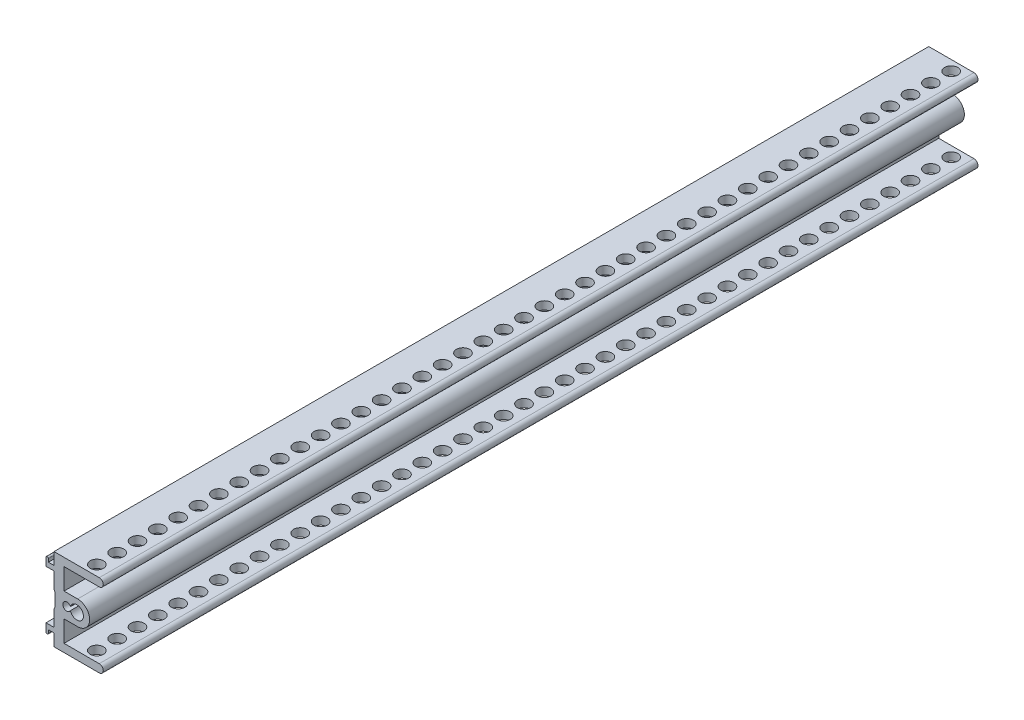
from build123d import *

# Parameters (mm, degrees)
EXTRUDE_1_DEPTH     = 109.22
SKETCH_3_R          = 1.65
CUT_EXTRUDE_1_DEPTH = 2.5


with BuildPart() as part:
    # Sketch 1 → Extrude 1 (new, symmetric)
    with BuildSketch(Plane.XY):
        with BuildLine():
            Line((-4.15, 8.3), (-4.15, 3))
            Line((-4.15, 3), (-0.75, 3))
            ThreePointArc((-0.75, 3), (2.25, 0), (-0.75, -3))
            Line((-0.75, -3), (-4.15, -3))
            Line((-4.15, -3), (-4.15, -8.3))
            Line((-4.15, -8.3), (4.65, -8.3))
            ThreePointArc((4.65, -8.3), (5.65, -9.3), (4.65, -10.3))
            Line((4.65, -10.3), (-6.65, -10.3))
            Line((-6.65, -10.3), (-6.65, -7.3))
            Line((-6.65, -7.3), (-8.05, -7.3))
            Line((-8.05, -7.3), (-8.05, -8.078245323))
            ThreePointArc((-8.05, -8.078245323), (-8.35, -8.378245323), (-8.65, -8.078245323))
            Line((-8.65, -8.078245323), (-8.65, -6.1))
            Line((-8.65, -6.1), (-6.65, -6.1))
            Line((-6.65, -6.1), (-6.65, -2.088438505))
            Line((-6.65, -2.088438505), (-6.35, -1.488438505))
            Line((-6.35, -1.488438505), (-6.35, 1.511561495))
            Line((-6.35, 1.511561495), (-6.65, 2.111561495))
            Line((-6.65, 2.111561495), (-6.65, 6.1))
            Line((-6.65, 6.1), (-8.65, 6.1))
            Line((-8.65, 6.1), (-8.65, 8.078245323))
            ThreePointArc((-8.65, 8.078245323), (-8.35, 8.378245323), (-8.05, 8.078245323))
            Line((-8.05, 8.078245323), (-8.05, 7.3))
            Line((-8.05, 7.3), (-6.65, 7.3))
            Line((-6.65, 7.3), (-6.65, 10.3))
            Line((-6.65, 10.3), (4.65, 10.3))
            ThreePointArc((4.65, 10.3), (5.65, 9.3), (4.65, 8.3))
            Line((4.65, 8.3), (-4.15, 8.3))
        make_face()
        with BuildLine():
            ThreePointArc((-2.5445, -0.424346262), (0.7, 0), (-2.5445, 0.424346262))
            ThreePointArc((-2.5445, 0.424346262), (-4.45, 0), (-2.5445, -0.424346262))
        make_face(mode=Mode.SUBTRACT)
    extrude(amount=EXTRUDE_1_DEPTH, both=True)

    # Sketch 3 → Cut-Extrude 1 (cut)
    with BuildSketch(Plane.XZ.offset(10.3)):
        with Locations((1.5, 106.68)):
            Circle(SKETCH_3_R)
        with Locations((1.5, 101.6)):
            Circle(SKETCH_3_R)
        with Locations((1.5, 96.52)):
            Circle(SKETCH_3_R)
        with Locations((1.5, 91.44)):
            Circle(SKETCH_3_R)
        with Locations((1.5, 86.36)):
            Circle(SKETCH_3_R)
        with Locations((1.5, 81.28)):
            Circle(SKETCH_3_R)
        with Locations((1.5, 76.2)):
            Circle(SKETCH_3_R)
        with Locations((1.5, 71.12)):
            Circle(SKETCH_3_R)
        with Locations((1.5, 66.04)):
            Circle(SKETCH_3_R)
        with Locations((1.5, 60.96)):
            Circle(SKETCH_3_R)
        with Locations((1.5, 55.88)):
            Circle(SKETCH_3_R)
        with Locations((1.5, 50.8)):
            Circle(SKETCH_3_R)
        with Locations((1.5, 45.72)):
            Circle(SKETCH_3_R)
        with Locations((1.5, 40.64)):
            Circle(SKETCH_3_R)
        with Locations((1.5, 35.56)):
            Circle(SKETCH_3_R)
        with Locations((1.5, 30.48)):
            Circle(SKETCH_3_R)
        with Locations((1.5, 25.4)):
            Circle(SKETCH_3_R)
        with Locations((1.5, 20.32)):
            Circle(SKETCH_3_R)
        with Locations((1.5, 15.24)):
            Circle(SKETCH_3_R)
        with Locations((1.5, 10.16)):
            Circle(SKETCH_3_R)
        with Locations((1.5, 5.08)):
            Circle(SKETCH_3_R)
        with Locations((1.5, 0)):
            Circle(SKETCH_3_R)
        with Locations((1.5, -5.08)):
            Circle(SKETCH_3_R)
        with Locations((1.5, -10.16)):
            Circle(SKETCH_3_R)
        with Locations((1.5, -15.24)):
            Circle(SKETCH_3_R)
        with Locations((1.5, -20.32)):
            Circle(SKETCH_3_R)
        with Locations((1.5, -25.4)):
            Circle(SKETCH_3_R)
        with Locations((1.5, -30.48)):
            Circle(SKETCH_3_R)
        with Locations((1.5, -35.56)):
            Circle(SKETCH_3_R)
        with Locations((1.5, -40.64)):
            Circle(SKETCH_3_R)
        with Locations((1.5, -45.72)):
            Circle(SKETCH_3_R)
        with Locations((1.5, -50.8)):
            Circle(SKETCH_3_R)
        with Locations((1.5, -55.88)):
            Circle(SKETCH_3_R)
        with Locations((1.5, -60.96)):
            Circle(SKETCH_3_R)
        with Locations((1.5, -66.04)):
            Circle(SKETCH_3_R)
        with Locations((1.5, -71.12)):
            Circle(SKETCH_3_R)
        with Locations((1.5, -76.2)):
            Circle(SKETCH_3_R)
        with Locations((1.5, -81.28)):
            Circle(SKETCH_3_R)
        with Locations((1.5, -86.36)):
            Circle(SKETCH_3_R)
        with Locations((1.5, -91.44)):
            Circle(SKETCH_3_R)
        with Locations((1.5, -96.52)):
            Circle(SKETCH_3_R)
        with Locations((1.5, -101.6)):
            Circle(SKETCH_3_R)
        with Locations((1.5, -106.68)):
            Circle(SKETCH_3_R)
        with Locations((1.5, -111.76)):
            Circle(SKETCH_3_R)
        with Locations((1.5, -116.84)):
            Circle(SKETCH_3_R)
        with Locations((1.5, -121.92)):
            Circle(SKETCH_3_R)
        with Locations((1.5, -127)):
            Circle(SKETCH_3_R)
        with Locations((1.5, -132.08)):
            Circle(SKETCH_3_R)
        with Locations((1.5, -137.16)):
            Circle(SKETCH_3_R)
        with Locations((1.5, -142.24)):
            Circle(SKETCH_3_R)
        with Locations((1.5, -147.32)):
            Circle(SKETCH_3_R)
        with Locations((1.5, -152.4)):
            Circle(SKETCH_3_R)
        with Locations((1.5, -157.48)):
            Circle(SKETCH_3_R)
        with Locations((1.5, -162.56)):
            Circle(SKETCH_3_R)
        with Locations((1.5, -167.64)):
            Circle(SKETCH_3_R)
        with Locations((1.5, -172.72)):
            Circle(SKETCH_3_R)
        with Locations((1.5, -177.8)):
            Circle(SKETCH_3_R)
        with Locations((1.5, -182.88)):
            Circle(SKETCH_3_R)
        with Locations((1.5, -187.96)):
            Circle(SKETCH_3_R)
        with Locations((1.5, -193.04)):
            Circle(SKETCH_3_R)
        with Locations((1.5, -198.12)):
            Circle(SKETCH_3_R)
        with Locations((1.5, -203.2)):
            Circle(SKETCH_3_R)
        with Locations((1.5, -208.28)):
            Circle(SKETCH_3_R)
        with Locations((1.5, -213.36)):
            Circle(SKETCH_3_R)
        with Locations((1.5, -218.44)):
            Circle(SKETCH_3_R)
        with Locations((1.5, -223.52)):
            Circle(SKETCH_3_R)
        with Locations((1.5, -228.6)):
            Circle(SKETCH_3_R)
        with Locations((1.5, -233.68)):
            Circle(SKETCH_3_R)
        with Locations((1.5, -238.76)):
            Circle(SKETCH_3_R)
        with Locations((1.5, -243.84)):
            Circle(SKETCH_3_R)
        with Locations((1.5, -248.92)):
            Circle(SKETCH_3_R)
        with Locations((1.5, -254)):
            Circle(SKETCH_3_R)
        with Locations((1.5, -259.08)):
            Circle(SKETCH_3_R)
        with Locations((1.5, -264.16)):
            Circle(SKETCH_3_R)
        with Locations((1.5, -269.24)):
            Circle(SKETCH_3_R)
        with Locations((1.5, -274.32)):
            Circle(SKETCH_3_R)
        with Locations((1.5, -279.4)):
            Circle(SKETCH_3_R)
        with Locations((1.5, -284.48)):
            Circle(SKETCH_3_R)
        with Locations((1.5, -289.56)):
            Circle(SKETCH_3_R)
        with Locations((1.5, -294.64)):
            Circle(SKETCH_3_R)
        with Locations((1.5, -299.72)):
            Circle(SKETCH_3_R)
        with Locations((1.5, -304.8)):
            Circle(SKETCH_3_R)
        with Locations((1.5, -309.88)):
            Circle(SKETCH_3_R)
        with Locations((1.5, -314.96)):
            Circle(SKETCH_3_R)
        with Locations((1.5, -320.04)):
            Circle(SKETCH_3_R)
    cut_extrude_1 = extrude(amount=-CUT_EXTRUDE_1_DEPTH, mode=Mode.SUBTRACT)

    # Mirror 1: Cut-Extrude 1 across plane
    add(cut_extrude_1.mirror(Plane.ZX), mode=Mode.SUBTRACT)


solid = part.part
